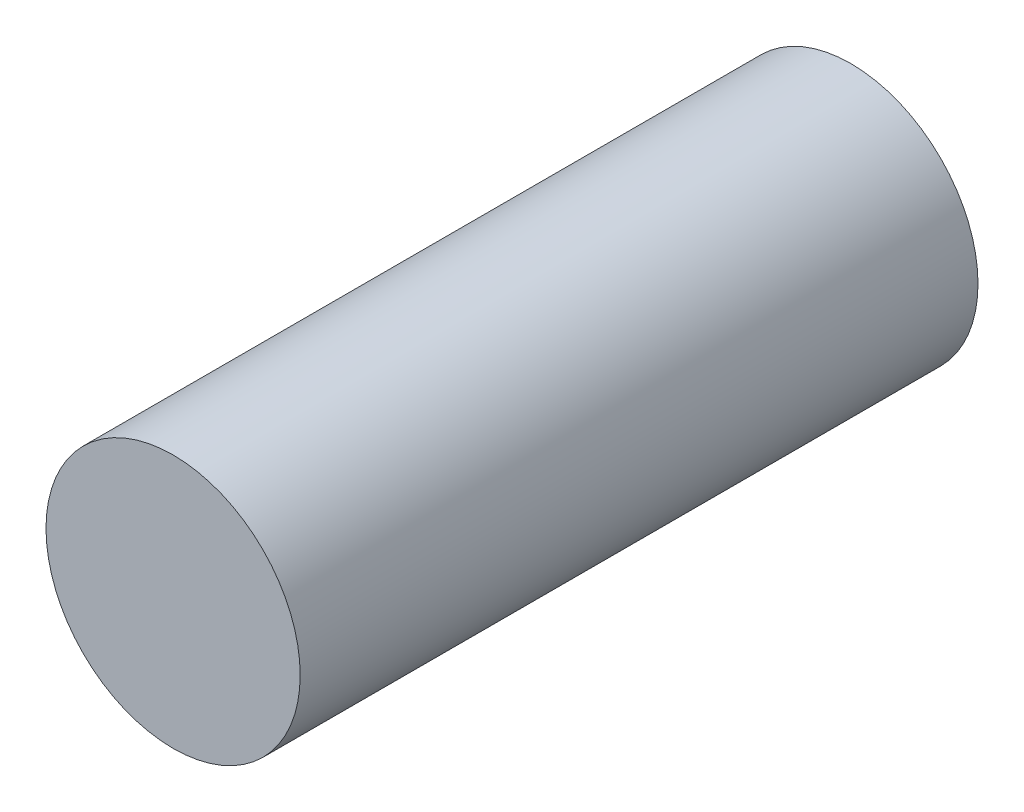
ISO-10303-21;
HEADER;
FILE_DESCRIPTION(('STEP AP214'),'2;1');
FILE_NAME('part.step','',(''),(''),'','','');
FILE_SCHEMA(('AUTOMOTIVE_DESIGN { 1 0 10303 214 1 1 1 1 }'));
ENDSEC;
DATA;
#1=APPLICATION_CONTEXT('core data for automotive mechanical design processes');
#2=APPLICATION_PROTOCOL_DEFINITION('international standard','automotive_design',2000,#1);
#3=PRODUCT_CONTEXT('',#1,'mechanical');
#4=PRODUCT('Part','Part','',(#3));
#5=PRODUCT_RELATED_PRODUCT_CATEGORY('part','',(#4));
#6=PRODUCT_DEFINITION_FORMATION('','',#4);
#7=PRODUCT_DEFINITION_CONTEXT('part definition',#1,'design');
#8=PRODUCT_DEFINITION('design','',#6,#7);
#9=PRODUCT_DEFINITION_SHAPE('','',#8);
#10=(LENGTH_UNIT() NAMED_UNIT(*) SI_UNIT(.MILLI.,.METRE.));
#11=(NAMED_UNIT(*) PLANE_ANGLE_UNIT() SI_UNIT($,.RADIAN.));
#12=(NAMED_UNIT(*) SI_UNIT($,.STERADIAN.) SOLID_ANGLE_UNIT());
#13=UNCERTAINTY_MEASURE_WITH_UNIT(LENGTH_MEASURE(1.E-05),#10,'distance_accuracy_value','');
#14=(GEOMETRIC_REPRESENTATION_CONTEXT(3) GLOBAL_UNCERTAINTY_ASSIGNED_CONTEXT((#13)) GLOBAL_UNIT_ASSIGNED_CONTEXT((#10,
#11,#12)) REPRESENTATION_CONTEXT('',''));
#15=CARTESIAN_POINT('',(0.,0.,0.));
#16=DIRECTION('',(0.,0.,1.));
#17=DIRECTION('',(1.,0.,0.));
#18=AXIS2_PLACEMENT_3D('',#15,#16,#17);
#19=CARTESIAN_POINT('',(0.,0.,40.));
#20=DIRECTION('',(0.,0.,-1.));
#21=DIRECTION('',(-1.,0.,0.));
#22=AXIS2_PLACEMENT_3D('',#19,#20,#21);
#23=CYLINDRICAL_SURFACE('',#22,7.5);
#24=CARTESIAN_POINT('',(0.,0.,40.));
#25=DIRECTION('',(0.,0.,1.));
#26=DIRECTION('',(1.,0.,0.));
#27=AXIS2_PLACEMENT_3D('',#24,#25,#26);
#28=CIRCLE('',#27,7.5);
#29=CARTESIAN_POINT('',(7.5,0.,40.));
#30=VERTEX_POINT('',#29);
#31=EDGE_CURVE('E10',#30,#30,#28,.T.);
#32=ORIENTED_EDGE('',*,*,#31,.F.);
#33=EDGE_LOOP('',(#32));
#34=FACE_BOUND('',#33,.T.);
#35=CARTESIAN_POINT('',(0.,0.,0.));
#36=DIRECTION('',(0.,0.,1.));
#37=DIRECTION('',(1.,0.,0.));
#38=AXIS2_PLACEMENT_3D('',#35,#36,#37);
#39=CIRCLE('',#38,7.5);
#40=CARTESIAN_POINT('',(7.5,0.,0.));
#41=VERTEX_POINT('',#40);
#42=EDGE_CURVE('E33',#41,#41,#39,.T.);
#43=ORIENTED_EDGE('',*,*,#42,.T.);
#44=EDGE_LOOP('',(#43));
#45=FACE_BOUND('',#44,.T.);
#46=ADVANCED_FACE('F30',(#34,#45),#23,.T.);
#47=CARTESIAN_POINT('',(0.,0.,40.));
#48=DIRECTION('',(0.,0.,1.));
#49=DIRECTION('',(1.,0.,0.));
#50=AXIS2_PLACEMENT_3D('',#47,#48,#49);
#51=PLANE('',#50);
#52=ORIENTED_EDGE('',*,*,#31,.T.);
#53=EDGE_LOOP('',(#52));
#54=FACE_BOUND('',#53,.T.);
#55=ADVANCED_FACE('F45',(#54),#51,.T.);
#56=CARTESIAN_POINT('',(0.,0.,0.));
#57=DIRECTION('',(0.,0.,1.));
#58=DIRECTION('',(1.,0.,0.));
#59=AXIS2_PLACEMENT_3D('',#56,#57,#58);
#60=PLANE('',#59);
#61=ORIENTED_EDGE('',*,*,#42,.F.);
#62=EDGE_LOOP('',(#61));
#63=FACE_BOUND('',#62,.T.);
#64=ADVANCED_FACE('F43',(#63),#60,.F.);
#65=CLOSED_SHELL('',(#46,#55,#64));
#66=MANIFOLD_SOLID_BREP('B2',#65);
#67=ADVANCED_BREP_SHAPE_REPRESENTATION('',(#18,#66),#14);
#68=SHAPE_DEFINITION_REPRESENTATION(#9,#67);
ENDSEC;
END-ISO-10303-21;
